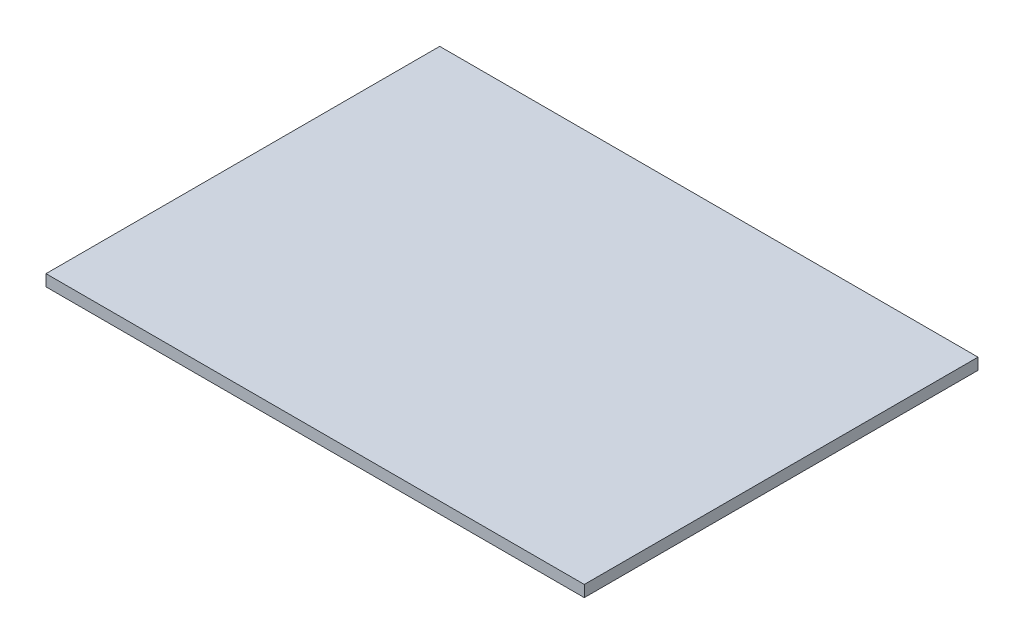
ISO-10303-21;
HEADER;
FILE_DESCRIPTION(('STEP AP214'),'2;1');
FILE_NAME('part.step','',(''),(''),'','','');
FILE_SCHEMA(('AUTOMOTIVE_DESIGN { 1 0 10303 214 1 1 1 1 }'));
ENDSEC;
DATA;
#1=APPLICATION_CONTEXT('core data for automotive mechanical design processes');
#2=APPLICATION_PROTOCOL_DEFINITION('international standard','automotive_design',2000,#1);
#3=PRODUCT_CONTEXT('',#1,'mechanical');
#4=PRODUCT('Part','Part','',(#3));
#5=PRODUCT_RELATED_PRODUCT_CATEGORY('part','',(#4));
#6=PRODUCT_DEFINITION_FORMATION('','',#4);
#7=PRODUCT_DEFINITION_CONTEXT('part definition',#1,'design');
#8=PRODUCT_DEFINITION('design','',#6,#7);
#9=PRODUCT_DEFINITION_SHAPE('','',#8);
#10=(LENGTH_UNIT() NAMED_UNIT(*) SI_UNIT(.MILLI.,.METRE.));
#11=(NAMED_UNIT(*) PLANE_ANGLE_UNIT() SI_UNIT($,.RADIAN.));
#12=(NAMED_UNIT(*) SI_UNIT($,.STERADIAN.) SOLID_ANGLE_UNIT());
#13=UNCERTAINTY_MEASURE_WITH_UNIT(LENGTH_MEASURE(1.E-05),#10,'distance_accuracy_value','');
#14=(GEOMETRIC_REPRESENTATION_CONTEXT(3) GLOBAL_UNCERTAINTY_ASSIGNED_CONTEXT((#13)) GLOBAL_UNIT_ASSIGNED_CONTEXT((#10,
#11,#12)) REPRESENTATION_CONTEXT('',''));
#15=CARTESIAN_POINT('',(0.,0.,0.));
#16=DIRECTION('',(0.,0.,1.));
#17=DIRECTION('',(1.,0.,0.));
#18=AXIS2_PLACEMENT_3D('',#15,#16,#17);
#19=CARTESIAN_POINT('',(29.35,39.8,-27.55));
#20=DIRECTION('',(0.,0.,-1.));
#21=DIRECTION('',(-1.,0.,0.));
#22=AXIS2_PLACEMENT_3D('',#19,#20,#21);
#23=PLANE('',#22);
#24=DIRECTION('',(0.,-1.,0.));
#25=VECTOR('',#24,1.);
#26=CARTESIAN_POINT('',(-45.85,39.8,-27.55));
#27=LINE('',#26,#25);
#28=CARTESIAN_POINT('',(-45.85,39.8,-27.55));
#29=VERTEX_POINT('',#28);
#30=CARTESIAN_POINT('',(-45.85,38.2,-27.55));
#31=VERTEX_POINT('',#30);
#32=EDGE_CURVE('E98',#29,#31,#27,.T.);
#33=ORIENTED_EDGE('',*,*,#32,.F.);
#34=DIRECTION('',(-1.,0.,0.));
#35=VECTOR('',#34,1.);
#36=CARTESIAN_POINT('',(29.35,39.8,-27.55));
#37=LINE('',#36,#35);
#38=CARTESIAN_POINT('',(29.35,39.8,-27.55));
#39=VERTEX_POINT('',#38);
#40=EDGE_CURVE('E11',#39,#29,#37,.T.);
#41=ORIENTED_EDGE('',*,*,#40,.F.);
#42=DIRECTION('',(0.,-1.,0.));
#43=VECTOR('',#42,1.);
#44=CARTESIAN_POINT('',(29.35,39.8,-27.55));
#45=LINE('',#44,#43);
#46=CARTESIAN_POINT('',(29.35,38.2,-27.55));
#47=VERTEX_POINT('',#46);
#48=EDGE_CURVE('E93',#39,#47,#45,.T.);
#49=ORIENTED_EDGE('',*,*,#48,.T.);
#50=DIRECTION('',(-1.,0.,0.));
#51=VECTOR('',#50,1.);
#52=CARTESIAN_POINT('',(29.35,38.2,-27.55));
#53=LINE('',#52,#51);
#54=EDGE_CURVE('E36',#47,#31,#53,.T.);
#55=ORIENTED_EDGE('',*,*,#54,.T.);
#56=EDGE_LOOP('',(#33,#41,#49,#55));
#57=FACE_BOUND('',#56,.T.);
#58=ADVANCED_FACE('F33',(#57),#23,.T.);
#59=CARTESIAN_POINT('',(29.35,39.8,-27.55));
#60=DIRECTION('',(0.,-1.,0.));
#61=DIRECTION('',(0.,0.,-1.));
#62=AXIS2_PLACEMENT_3D('',#59,#60,#61);
#63=PLANE('',#62);
#64=DIRECTION('',(0.,0.,1.));
#65=VECTOR('',#64,1.);
#66=CARTESIAN_POINT('',(-45.85,39.8,-27.55));
#67=LINE('',#66,#65);
#68=CARTESIAN_POINT('',(-45.85,39.8,27.45));
#69=VERTEX_POINT('',#68);
#70=EDGE_CURVE('E66',#29,#69,#67,.T.);
#71=ORIENTED_EDGE('',*,*,#70,.T.);
#72=DIRECTION('',(-1.,0.,0.));
#73=VECTOR('',#72,1.);
#74=CARTESIAN_POINT('',(29.35,39.8,27.45));
#75=LINE('',#74,#73);
#76=CARTESIAN_POINT('',(29.35,39.8,27.45));
#77=VERTEX_POINT('',#76);
#78=EDGE_CURVE('E42',#77,#69,#75,.T.);
#79=ORIENTED_EDGE('',*,*,#78,.F.);
#80=DIRECTION('',(0.,0.,1.));
#81=VECTOR('',#80,1.);
#82=CARTESIAN_POINT('',(29.35,39.8,-27.55));
#83=LINE('',#82,#81);
#84=EDGE_CURVE('E83',#39,#77,#83,.T.);
#85=ORIENTED_EDGE('',*,*,#84,.F.);
#86=ORIENTED_EDGE('',*,*,#40,.T.);
#87=EDGE_LOOP('',(#71,#79,#85,#86));
#88=FACE_BOUND('',#87,.T.);
#89=ADVANCED_FACE('F108',(#88),#63,.F.);
#90=CARTESIAN_POINT('',(29.35,39.8,27.45));
#91=DIRECTION('',(0.,0.,-1.));
#92=DIRECTION('',(-1.,0.,0.));
#93=AXIS2_PLACEMENT_3D('',#90,#91,#92);
#94=PLANE('',#93);
#95=DIRECTION('',(0.,-1.,0.));
#96=VECTOR('',#95,1.);
#97=CARTESIAN_POINT('',(-45.85,39.8,27.45));
#98=LINE('',#97,#96);
#99=CARTESIAN_POINT('',(-45.85,38.2,27.45));
#100=VERTEX_POINT('',#99);
#101=EDGE_CURVE('E90',#69,#100,#98,.T.);
#102=ORIENTED_EDGE('',*,*,#101,.T.);
#103=DIRECTION('',(-1.,0.,0.));
#104=VECTOR('',#103,1.);
#105=CARTESIAN_POINT('',(29.35,38.2,27.45));
#106=LINE('',#105,#104);
#107=CARTESIAN_POINT('',(29.35,38.2,27.45));
#108=VERTEX_POINT('',#107);
#109=EDGE_CURVE('E87',#108,#100,#106,.T.);
#110=ORIENTED_EDGE('',*,*,#109,.F.);
#111=DIRECTION('',(0.,-1.,0.));
#112=VECTOR('',#111,1.);
#113=CARTESIAN_POINT('',(29.35,39.8,27.45));
#114=LINE('',#113,#112);
#115=EDGE_CURVE('E78',#77,#108,#114,.T.);
#116=ORIENTED_EDGE('',*,*,#115,.F.);
#117=ORIENTED_EDGE('',*,*,#78,.T.);
#118=EDGE_LOOP('',(#102,#110,#116,#117));
#119=FACE_BOUND('',#118,.T.);
#120=ADVANCED_FACE('F88',(#119),#94,.F.);
#121=CARTESIAN_POINT('',(29.35,38.2,-27.55));
#122=DIRECTION('',(0.,-1.,0.));
#123=DIRECTION('',(0.,0.,-1.));
#124=AXIS2_PLACEMENT_3D('',#121,#122,#123);
#125=PLANE('',#124);
#126=DIRECTION('',(0.,0.,1.));
#127=VECTOR('',#126,1.);
#128=CARTESIAN_POINT('',(-45.85,38.2,-27.55));
#129=LINE('',#128,#127);
#130=EDGE_CURVE('E101',#31,#100,#129,.T.);
#131=ORIENTED_EDGE('',*,*,#130,.F.);
#132=ORIENTED_EDGE('',*,*,#54,.F.);
#133=DIRECTION('',(0.,0.,1.));
#134=VECTOR('',#133,1.);
#135=CARTESIAN_POINT('',(29.35,38.2,-27.55));
#136=LINE('',#135,#134);
#137=EDGE_CURVE('E82',#47,#108,#136,.T.);
#138=ORIENTED_EDGE('',*,*,#137,.T.);
#139=ORIENTED_EDGE('',*,*,#109,.T.);
#140=EDGE_LOOP('',(#131,#132,#138,#139));
#141=FACE_BOUND('',#140,.T.);
#142=ADVANCED_FACE('F92',(#141),#125,.T.);
#143=CARTESIAN_POINT('',(29.35,0.,0.));
#144=DIRECTION('',(-1.,0.,0.));
#145=DIRECTION('',(0.,0.,1.));
#146=AXIS2_PLACEMENT_3D('',#143,#144,#145);
#147=PLANE('',#146);
#148=ORIENTED_EDGE('',*,*,#48,.F.);
#149=ORIENTED_EDGE('',*,*,#84,.T.);
#150=ORIENTED_EDGE('',*,*,#115,.T.);
#151=ORIENTED_EDGE('',*,*,#137,.F.);
#152=EDGE_LOOP('',(#148,#149,#150,#151));
#153=FACE_BOUND('',#152,.T.);
#154=ADVANCED_FACE('F81',(#153),#147,.F.);
#155=CARTESIAN_POINT('',(-45.85,0.,0.));
#156=DIRECTION('',(-1.,0.,0.));
#157=DIRECTION('',(0.,0.,1.));
#158=AXIS2_PLACEMENT_3D('',#155,#156,#157);
#159=PLANE('',#158);
#160=ORIENTED_EDGE('',*,*,#32,.T.);
#161=ORIENTED_EDGE('',*,*,#130,.T.);
#162=ORIENTED_EDGE('',*,*,#101,.F.);
#163=ORIENTED_EDGE('',*,*,#70,.F.);
#164=EDGE_LOOP('',(#160,#161,#162,#163));
#165=FACE_BOUND('',#164,.T.);
#166=ADVANCED_FACE('F106',(#165),#159,.T.);
#167=CLOSED_SHELL('',(#58,#89,#120,#142,#154,#166));
#168=MANIFOLD_SOLID_BREP('B2',#167);
#169=ADVANCED_BREP_SHAPE_REPRESENTATION('',(#18,#168),#14);
#170=SHAPE_DEFINITION_REPRESENTATION(#9,#169);
ENDSEC;
END-ISO-10303-21;
